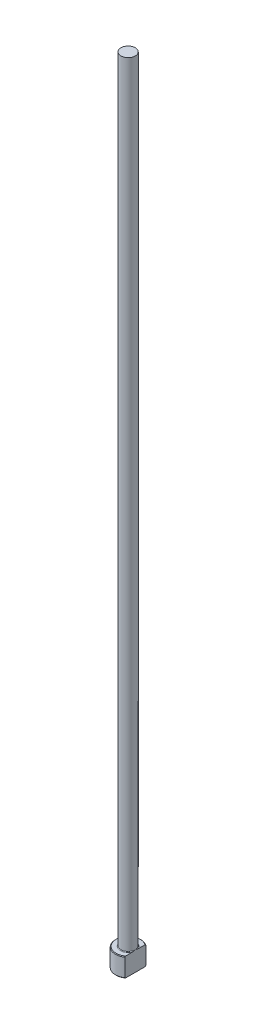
from build123d import *
from build123d.topology import SkipClean

# Parameters (mm, degrees)
CHAMFER1_SIZE    = 0.2
FILLET1_R        = 0.2
KEYED_HEAD_DEPTH = 251.06399181


with BuildPart() as part:
    # Sketch1 → Revolve1 (revolve)
    with BuildSketch(Plane.XY, mode=Mode.PRIVATE) as revolve1_sk:
        Polygon((0, 0), (-4, 0), (-4, 6), (-2.25, 6), (-2.25, 250), (0, 250), align=None)
    revolve(revolve1_sk.sketch.rotate(Axis((0, 259.958771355, 0), (0, -1, 0)), 270), axis=Axis((0, 259.958771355, 0), (0, -1, 0)))

    # Chamfer1
    chamfer1_edges = [part.edges().sort_by_distance(p)[0] for p in [
        (0, 6, -4),
        (0, 0, -4),
    ]]
    chamfer(chamfer1_edges, length=CHAMFER1_SIZE)

    # Fillet1
    fillet1_edges = [part.edges().sort_by_distance(p)[0] for p in [
        (0, 6, -2.25),
    ]]
    fillet(fillet1_edges, radius=FILLET1_R)

    # Sketch2 → KEYED HEAD (cut, through all)
    with SkipClean():  # the faces are left unmerged after this step: merging them gives an invalid solid
        with BuildSketch(Plane(origin=(0, 0, 0), x_dir=(1, 0, 0), z_dir=(0, 1, 0))):
            with BuildLine():
                Line((2.25, -3.307189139), (2.25, 3.307189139))
                ThreePointArc((2.25, 3.307189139), (4, 0), (2.25, -3.307189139))
            make_face()
        extrude(amount=KEYED_HEAD_DEPTH, mode=Mode.SUBTRACT)


solid = part.part
